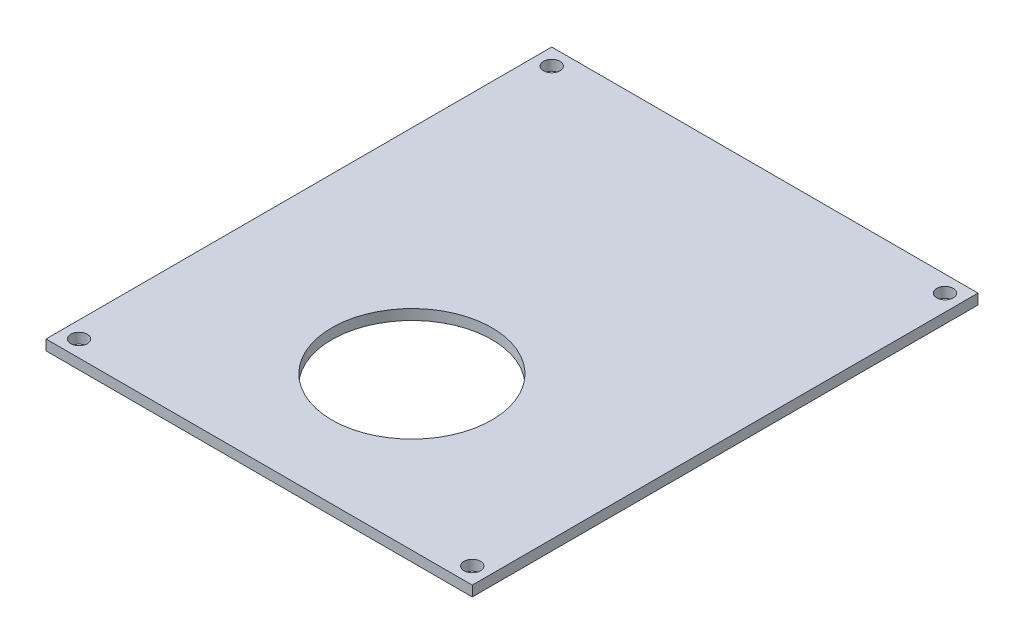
from build123d import *

# Parameters (mm, degrees)
SKETCH1_W                  = 82.6
SKETCH1_H                  = 98
BOSS_EXTRUDE1_DEPTH        = 2
F_3_2_3_2_DIAMETER_HOLE1_D = 3.2
SKETCH4_R                  = 15.5
CUT_EXTRUDE1_DEPTH         = 2


with BuildPart() as part:
    # Sketch1 → Boss-Extrude1 (new body)
    with BuildSketch(Plane(origin=(0, 0, 0), x_dir=(1, 0, 0), z_dir=(0, 1, 0))):
        Rectangle(SKETCH1_W, SKETCH1_H)
    extrude(amount=BOSS_EXTRUDE1_DEPTH)

    # 3.2 _3.2_ Diameter Hole1 (through all)
    with Locations(Plane(origin=(0, 2, 0), x_dir=(1, 0, 0), z_dir=(0, 1, 0))):
        with Locations((-38.1, 45.8), (38.1, 45.8), (38.1, -45.8), (-38.1, -45.8)):
            Hole(F_3_2_3_2_DIAMETER_HOLE1_D / 2)

    # Sketch4 → Cut-Extrude1 (cut)
    with BuildSketch(Plane(origin=(0, 2, 0), x_dir=(1, 0, 0), z_dir=(0, 1, 0))):
        with Locations(Location((0, -19.4, 0), (0, 0, 270))):
            Circle(SKETCH4_R)
    extrude(amount=-CUT_EXTRUDE1_DEPTH, mode=Mode.SUBTRACT)


solid = part.part
